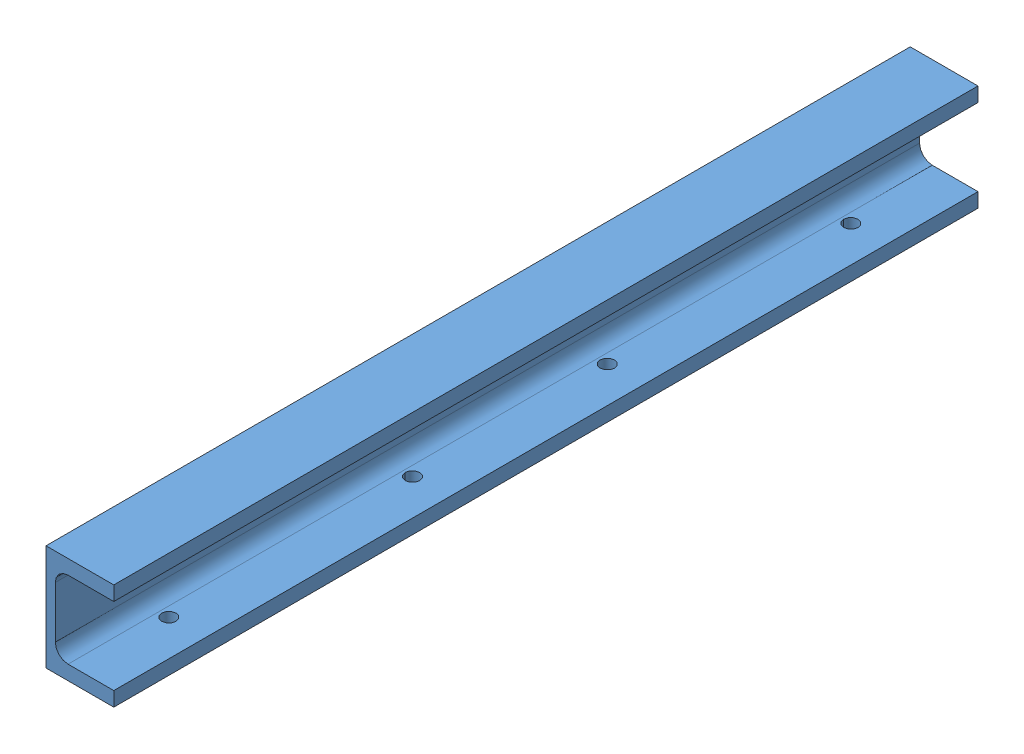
SolidWorks assembly Beam.SLDASM, configuration Initial (file format 15000). Lengths in mm.
Overall size (32 50 408).
3 component instances, 2 part files, 6 mates.
Components (placement in the parent):
- 3930-10452-4-01-1: 3930-10452-4-01.SLDPRT [Výchozí] at origin size (32 50 408)
- 3930-10104-4-01-1: 3930-10104-4-01.SLDPRT [Výchozí] at (2.5 0 199) (suppressed, hidden)
- 3930-10104-4-01-2: 3930-10104-4-01.SLDPRT [Výchozí] at (2.5 0 -204) (suppressed, hidden)
Mates (geometry in assembly coordinates):
- Sjednocený1: coincident aligned: plane of 3930-10452-4-01-1 through (-5.6 12.2 204) normal (0 0 1); plane of 3930-10104-4-01-1 through (-11 -18 204) normal (0 0 1)
- Sjednocený2: coincident aligned: plane of 3930-10452-4-01-1 through (16 25 204) normal (1 0 0); plane of 3930-10104-4-01-1 through (16 18 204) normal (1 0 0)
- Sjednocený3: coincident: plane of 3930-10104-4-01-1; plane of assembly through (0 0 0) normal (0 1 0)
- Sjednocený4: coincident aligned: plane of 3930-10452-4-01-1 through (-5.6 12.2 -204) normal (0 0 -1); plane of 3930-10104-4-01-2 through (-11 -18 -204) normal (0 0 -1)
- Sjednocený5: coincident aligned: plane of 3930-10452-4-01-1 through (16 25 204) normal (1 0 0); plane of assembly through (16 18 -199) normal (1 0 0)
- Soustředný1: concentric: cylinder of 3930-10104-4-01-1 through (6 0 204) axis (0 0 1) radius 4; cylinder of 3930-10104-4-01-2 through (6 0 -199) axis (0 0 1) radius 4
